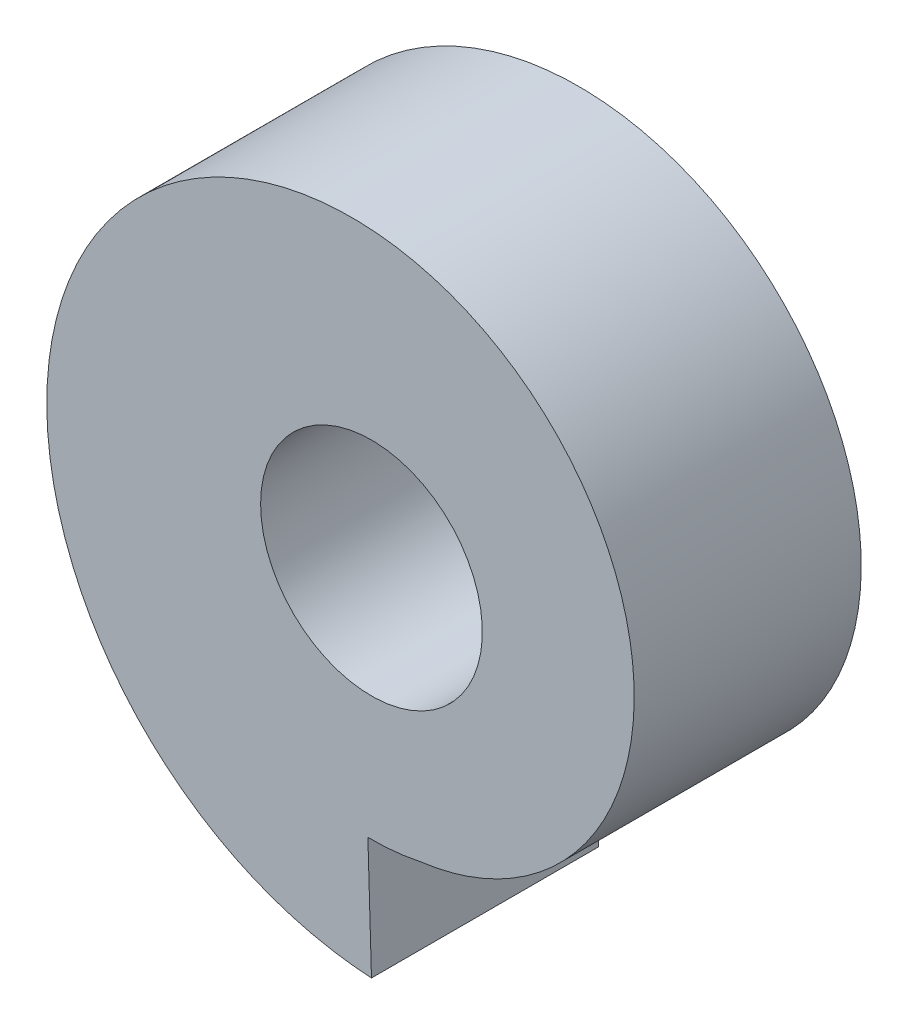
ISO-10303-21;
HEADER;
FILE_DESCRIPTION(('STEP AP214'),'2;1');
FILE_NAME('part.step','',(''),(''),'','','');
FILE_SCHEMA(('AUTOMOTIVE_DESIGN { 1 0 10303 214 1 1 1 1 }'));
ENDSEC;
DATA;
#1=APPLICATION_CONTEXT('core data for automotive mechanical design processes');
#2=APPLICATION_PROTOCOL_DEFINITION('international standard','automotive_design',2000,#1);
#3=PRODUCT_CONTEXT('',#1,'mechanical');
#4=PRODUCT('Part','Part','',(#3));
#5=PRODUCT_RELATED_PRODUCT_CATEGORY('part','',(#4));
#6=PRODUCT_DEFINITION_FORMATION('','',#4);
#7=PRODUCT_DEFINITION_CONTEXT('part definition',#1,'design');
#8=PRODUCT_DEFINITION('design','',#6,#7);
#9=PRODUCT_DEFINITION_SHAPE('','',#8);
#10=(LENGTH_UNIT() NAMED_UNIT(*) SI_UNIT(.MILLI.,.METRE.));
#11=(NAMED_UNIT(*) PLANE_ANGLE_UNIT() SI_UNIT($,.RADIAN.));
#12=(NAMED_UNIT(*) SI_UNIT($,.STERADIAN.) SOLID_ANGLE_UNIT());
#13=UNCERTAINTY_MEASURE_WITH_UNIT(LENGTH_MEASURE(1.E-05),#10,'distance_accuracy_value','');
#14=(GEOMETRIC_REPRESENTATION_CONTEXT(3) GLOBAL_UNCERTAINTY_ASSIGNED_CONTEXT((#13)) GLOBAL_UNIT_ASSIGNED_CONTEXT((#10,
#11,#12)) REPRESENTATION_CONTEXT('',''));
#15=CARTESIAN_POINT('',(0.,0.,0.));
#16=DIRECTION('',(0.,0.,1.));
#17=DIRECTION('',(1.,0.,0.));
#18=AXIS2_PLACEMENT_3D('',#15,#16,#17);
#19=CARTESIAN_POINT('',(-0.158316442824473,-26.1424127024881,0.));
#20=DIRECTION('',(-0.999556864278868,-0.0297670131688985,0.));
#21=DIRECTION('',(0.0297670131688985,-0.999556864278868,0.));
#22=AXIS2_PLACEMENT_3D('',#19,#20,#21);
#23=PLANE('',#22);
#24=DIRECTION('',(-0.0297670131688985,0.999556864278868,0.));
#25=VECTOR('',#24,1.);
#26=CARTESIAN_POINT('',(-0.158316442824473,-26.1424127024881,0.));
#27=LINE('',#26,#25);
#28=CARTESIAN_POINT('',(0.,-31.4585754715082,0.));
#29=VERTEX_POINT('',#28);
#30=CARTESIAN_POINT('',(-0.31663288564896,-20.826249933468,0.));
#31=VERTEX_POINT('',#30);
#32=EDGE_CURVE('E50',#29,#31,#27,.T.);
#33=ORIENTED_EDGE('',*,*,#32,.T.);
#34=DIRECTION('',(0.,0.,1.));
#35=VECTOR('',#34,1.);
#36=CARTESIAN_POINT('',(-0.31663288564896,-20.826249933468,10.0559952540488));
#37=LINE('',#36,#35);
#38=CARTESIAN_POINT('',(-0.31663288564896,-20.826249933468,20.1119905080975));
#39=VERTEX_POINT('',#38);
#40=EDGE_CURVE('E75',#31,#39,#37,.T.);
#41=ORIENTED_EDGE('',*,*,#40,.T.);
#42=DIRECTION('',(0.0297670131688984,-0.999556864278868,0.));
#43=VECTOR('',#42,1.);
#44=CARTESIAN_POINT('',(-0.158316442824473,-26.1424127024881,20.1119905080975));
#45=LINE('',#44,#43);
#46=CARTESIAN_POINT('',(0.,-31.4585754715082,20.1119905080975));
#47=VERTEX_POINT('',#46);
#48=EDGE_CURVE('E81',#39,#47,#45,.T.);
#49=ORIENTED_EDGE('',*,*,#48,.T.);
#50=DIRECTION('',(0.,0.,-1.));
#51=VECTOR('',#50,1.);
#52=CARTESIAN_POINT('',(0.,-31.4585754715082,10.0559952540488));
#53=LINE('',#52,#51);
#54=EDGE_CURVE('E92',#47,#29,#53,.T.);
#55=ORIENTED_EDGE('',*,*,#54,.T.);
#56=EDGE_LOOP('',(#33,#41,#49,#55));
#57=FACE_BOUND('',#56,.T.);
#58=ADVANCED_FACE('F42',(#57),#23,.F.);
#59=CARTESIAN_POINT('',(0.,-20.4585754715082,0.));
#60=DIRECTION('',(0.,0.,-1.));
#61=DIRECTION('',(0.,1.,0.));
#62=AXIS2_PLACEMENT_3D('',#59,#60,#61);
#63=PLANE('',#62);
#64=CARTESIAN_POINT('',(0.,0.,0.));
#65=DIRECTION('',(0.,0.,-1.));
#66=DIRECTION('',(-1.,0.,0.));
#67=AXIS2_PLACEMENT_3D('',#64,#65,#66);
#68=CIRCLE('',#67,9.82153628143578);
#69=CARTESIAN_POINT('',(-9.82153628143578,0.,0.));
#70=VERTEX_POINT('',#69);
#71=EDGE_CURVE('E78',#70,#70,#68,.T.);
#72=ORIENTED_EDGE('',*,*,#71,.F.);
#73=EDGE_LOOP('',(#72));
#74=FACE_BOUND('',#73,.T.);
#75=CARTESIAN_POINT('',(0.,-20.4585754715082,0.));
#76=CARTESIAN_POINT('',(1.3390106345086,-20.5731588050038,0.));
#77=CARTESIAN_POINT('',(2.70063028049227,-20.5558502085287,0.));
#78=CARTESIAN_POINT('',(5.41603446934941,-20.2493790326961,0.));
#79=CARTESIAN_POINT('',(6.76974749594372,-19.9602018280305,0.));
#80=CARTESIAN_POINT('',(9.41475798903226,-19.1126508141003,0.));
#81=CARTESIAN_POINT('',(10.7059814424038,-18.5542770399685,0.));
#82=CARTESIAN_POINT('',(13.172233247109,-17.18199666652,0.));
#83=CARTESIAN_POINT('',(14.3471880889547,-16.368105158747,0.));
#84=CARTESIAN_POINT('',(16.5301504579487,-14.5092333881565,0.));
#85=CARTESIAN_POINT('',(17.5380880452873,-13.464283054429,0.));
#86=CARTESIAN_POINT('',(19.3414563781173,-11.1778407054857,0.));
#87=CARTESIAN_POINT('',(20.1368237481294,-9.93639261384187,0.));
#88=CARTESIAN_POINT('',(21.4766976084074,-7.30049231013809,0.));
#89=CARTESIAN_POINT('',(22.0211500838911,-5.90609656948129,0.));
#90=CARTESIAN_POINT('',(22.8298184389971,-3.01531575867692,0.));
#91=CARTESIAN_POINT('',(23.0939921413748,-1.5189977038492,0.));
#92=CARTESIAN_POINT('',(23.3231588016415,1.5189977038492,0.));
#93=CARTESIAN_POINT('',(23.2881234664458,3.06059998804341,0.));
#94=CARTESIAN_POINT('',(22.9114248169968,6.12906153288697,0.));
#95=CARTESIAN_POINT('',(22.5697486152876,7.65584055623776,0.));
#96=CARTESIAN_POINT('',(21.5844414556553,10.6334238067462,0.));
#97=CARTESIAN_POINT('',(20.940813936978,12.0841457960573,0.));
#98=CARTESIAN_POINT('',(19.3685426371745,14.8497051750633,0.));
#99=CARTESIAN_POINT('',(18.4399188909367,16.1644616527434,0.));
#100=CARTESIAN_POINT('',(16.3265069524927,18.601964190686,0.));
#101=CARTESIAN_POINT('',(15.1417549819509,19.7246340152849,0.));
#102=CARTESIAN_POINT('',(12.5560050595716,21.7279932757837,0.));
#103=CARTESIAN_POINT('',(11.1550584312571,22.6086143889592,0.));
#104=CARTESIAN_POINT('',(8.18658537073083,24.0862443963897,0.));
#105=CARTESIAN_POINT('',(6.61912363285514,24.6831958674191,0.));
#106=CARTESIAN_POINT('',(3.37528546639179,25.5620916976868,0.));
#107=CARTESIAN_POINT('',(1.69898478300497,25.8439921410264,0.));
#108=CARTESIAN_POINT('',(-1.69898478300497,26.07315880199,0.));
#109=CARTESIAN_POINT('',(-3.42056969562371,26.0203967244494,0.));
#110=CARTESIAN_POINT('',(-6.84208859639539,25.573470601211,0.));
#111=CARTESIAN_POINT('',(-8.54193361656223,25.1792954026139,0.));
#112=CARTESIAN_POINT('',(-11.8520896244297,24.056232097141,0.));
#113=CARTESIAN_POINT('',(-13.4623101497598,23.327350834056,0.));
#114=CARTESIAN_POINT('',(-16.5271771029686,21.5550886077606,0.));
#115=CARTESIAN_POINT('',(-17.9817352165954,20.5117326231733,0.));
#116=CARTESIAN_POINT('',(-20.6737779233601,18.1437805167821,0.));
#117=CARTESIAN_POINT('',(-21.9111799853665,16.8192269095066,0.));
#118=CARTESIAN_POINT('',(-24.114530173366,13.9341694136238,0.));
#119=CARTESIAN_POINT('',(-25.080405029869,12.373724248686,0.));
#120=CARTESIAN_POINT('',(-26.6957911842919,9.07267843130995,0.));
#121=CARTESIAN_POINT('',(-27.3452416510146,7.33215069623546,0.));
#122=CARTESIAN_POINT('',(-28.2943649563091,3.73525517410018,0.));
#123=CARTESIAN_POINT('',(-28.5939921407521,1.87897186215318,0.));
#124=CARTESIAN_POINT('',(-28.8231588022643,-1.87897186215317,0.));
#125=CARTESIAN_POINT('',(-28.7526699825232,-3.78053940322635,0.));
#126=CARTESIAN_POINT('',(-28.2355163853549,-7.55511565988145,0.));
#127=CARTESIAN_POINT('',(-27.7888421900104,-9.42802667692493,0.));
#128=CARTESIAN_POINT('',(-26.5280227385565,-13.070755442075,0.));
#129=CARTESIAN_POINT('',(-25.7138877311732,-14.8404745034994,0.));
#130=CARTESIAN_POINT('',(-23.7416345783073,-18.2046490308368,0.));
#131=CARTESIAN_POINT('',(-22.5835463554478,-19.7990087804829,0.));
#132=CARTESIAN_POINT('',(-19.9610540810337,-22.7455916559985,0.));
#133=CARTESIAN_POINT('',(-18.4966988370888,-24.0977259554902,0.));
#134=CARTESIAN_POINT('',(-15.3123337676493,-26.5010670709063,0.));
#135=CARTESIAN_POINT('',(-13.5923900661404,-27.5521956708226,0.));
#136=CARTESIAN_POINT('',(-9.95877149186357,-29.3053379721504,0.));
#137=CARTESIAN_POINT('',(-8.04517775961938,-30.0072874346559,0.));
#138=CARTESIAN_POINT('',(-4.09522488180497,-31.0266382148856,0.));
#139=CARTESIAN_POINT('',(-2.05895895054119,-31.3439921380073,0.));
#140=CARTESIAN_POINT('',(0.,-31.4585754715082,0.));
#141=B_SPLINE_CURVE_WITH_KNOTS('',3,(#75,#76,#77,#78,#79,#80,#81,#82,#83,#84,#85,#86,#87,#88,
#89,#90,#91,#92,#93,#94,#95,#96,#97,#98,#99,#100,#101,#102,#103,#104,#105,#106,#107,#108,#109,
#110,#111,#112,#113,#114,#115,#116,#117,#118,#119,#120,#121,#122,#123,#124,#125,#126,#127,#128,
#129,#130,#131,#132,#133,#134,#135,#136,#137,#138,#139,#140),.UNSPECIFIED.,.F.,.F.,(4,2,2,2,2,2,
2,2,2,2,2,2,2,2,2,2,2,2,2,2,2,2,2,2,2,2,2,2,2,2,2,2,4),(0.,0.03125,0.0625,0.09375,0.125,0.15625,
0.1875,0.21875,0.25,0.28125,0.3125,0.34375,0.375,0.40625,0.4375,0.46875,0.5,0.53125,0.5625,
0.59375,0.625,0.65625,0.6875,0.71875,0.75,0.78125,0.8125,0.84375,0.875,0.90625,0.9375,0.96875,
1.),.UNSPECIFIED.);
#142=CARTESIAN_POINT('',(4.37032876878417,-20.3649986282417,0.));
#143=VERTEX_POINT('',#142);
#144=EDGE_CURVE('E94',#143,#29,#141,.T.);
#145=ORIENTED_EDGE('',*,*,#144,.F.);
#146=CARTESIAN_POINT('',(0.,0.,0.));
#147=DIRECTION('',(0.,0.,-1.));
#148=DIRECTION('',(-1.,0.,0.));
#149=AXIS2_PLACEMENT_3D('',#146,#147,#148);
#150=CIRCLE('',#149,20.8286567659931);
#151=EDGE_CURVE('E112',#143,#31,#150,.T.);
#152=ORIENTED_EDGE('',*,*,#151,.T.);
#153=ORIENTED_EDGE('',*,*,#32,.F.);
#154=EDGE_LOOP('',(#145,#152,#153));
#155=FACE_BOUND('',#154,.T.);
#156=ADVANCED_FACE('F111',(#74,#155),#63,.T.);
#157=CARTESIAN_POINT('',(0.,-9.82153628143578,20.1119905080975));
#158=DIRECTION('',(0.,0.,1.));
#159=DIRECTION('',(0.,-1.,0.));
#160=AXIS2_PLACEMENT_3D('',#157,#158,#159);
#161=PLANE('',#160);
#162=ORIENTED_EDGE('',*,*,#48,.F.);
#163=CARTESIAN_POINT('',(0.,0.,20.1119905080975));
#164=DIRECTION('',(0.,0.,1.));
#165=DIRECTION('',(1.,0.,0.));
#166=AXIS2_PLACEMENT_3D('',#163,#164,#165);
#167=CIRCLE('',#166,20.8286567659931);
#168=CARTESIAN_POINT('',(4.37032876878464,-20.3649986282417,20.1119905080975));
#169=VERTEX_POINT('',#168);
#170=EDGE_CURVE('E57',#169,#39,#167,.F.);
#171=ORIENTED_EDGE('',*,*,#170,.F.);
#172=CARTESIAN_POINT('',(0.,-20.4585754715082,20.1119905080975));
#173=CARTESIAN_POINT('',(1.3390106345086,-20.5731588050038,20.1119905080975));
#174=CARTESIAN_POINT('',(2.70063028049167,-20.5558502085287,20.1119905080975));
#175=CARTESIAN_POINT('',(5.41603446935,-20.2493790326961,20.1119905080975));
#176=CARTESIAN_POINT('',(6.76974749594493,-19.9602018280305,20.1119905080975));
#177=CARTESIAN_POINT('',(9.41475798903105,-19.1126508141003,20.1119905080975));
#178=CARTESIAN_POINT('',(10.7059814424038,-18.5542770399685,20.1119905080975));
#179=CARTESIAN_POINT('',(13.172233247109,-17.18199666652,20.1119905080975));
#180=CARTESIAN_POINT('',(14.3471880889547,-16.368105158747,20.1119905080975));
#181=CARTESIAN_POINT('',(16.5301504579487,-14.5092333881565,20.1119905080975));
#182=CARTESIAN_POINT('',(17.5380880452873,-13.464283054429,20.1119905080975));
#183=CARTESIAN_POINT('',(19.3414563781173,-11.1778407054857,20.1119905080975));
#184=CARTESIAN_POINT('',(20.1368237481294,-9.93639261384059,20.1119905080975));
#185=CARTESIAN_POINT('',(21.4766976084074,-7.30049231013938,20.1119905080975));
#186=CARTESIAN_POINT('',(22.0211500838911,-5.90609656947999,20.1119905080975));
#187=CARTESIAN_POINT('',(22.8298184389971,-3.01531575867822,20.1119905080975));
#188=CARTESIAN_POINT('',(23.0939921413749,-1.5189977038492,20.1119905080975));
#189=CARTESIAN_POINT('',(23.3231588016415,1.5189977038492,20.1119905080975));
#190=CARTESIAN_POINT('',(23.2881234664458,3.06059998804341,20.1119905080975));
#191=CARTESIAN_POINT('',(22.9114248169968,6.12906153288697,20.1119905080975));
#192=CARTESIAN_POINT('',(22.5697486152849,7.65584055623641,20.1119905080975));
#193=CARTESIAN_POINT('',(21.584441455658,10.6334238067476,20.1119905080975));
#194=CARTESIAN_POINT('',(20.940813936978,12.0841457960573,20.1119905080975));
#195=CARTESIAN_POINT('',(19.3685426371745,14.8497051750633,20.1119905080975));
#196=CARTESIAN_POINT('',(18.4399188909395,16.1644616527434,20.1119905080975));
#197=CARTESIAN_POINT('',(16.3265069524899,18.601964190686,20.1119905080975));
#198=CARTESIAN_POINT('',(15.1417549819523,19.7246340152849,20.1119905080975));
#199=CARTESIAN_POINT('',(12.5560050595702,21.7279932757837,20.1119905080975));
#200=CARTESIAN_POINT('',(11.1550584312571,22.6086143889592,20.1119905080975));
#201=CARTESIAN_POINT('',(8.18658537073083,24.0862443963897,20.1119905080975));
#202=CARTESIAN_POINT('',(6.61912363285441,24.6831958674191,20.1119905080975));
#203=CARTESIAN_POINT('',(3.37528546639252,25.5620916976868,20.1119905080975));
#204=CARTESIAN_POINT('',(1.69898478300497,25.8439921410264,20.1119905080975));
#205=CARTESIAN_POINT('',(-1.69898478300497,26.07315880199,20.1119905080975));
#206=CARTESIAN_POINT('',(-3.42056969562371,26.0203967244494,20.1119905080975));
#207=CARTESIAN_POINT('',(-6.84208859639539,25.573470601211,20.1119905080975));
#208=CARTESIAN_POINT('',(-8.54193361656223,25.1792954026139,20.1119905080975));
#209=CARTESIAN_POINT('',(-11.8520896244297,24.056232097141,20.1119905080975));
#210=CARTESIAN_POINT('',(-13.4623101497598,23.327350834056,20.1119905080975));
#211=CARTESIAN_POINT('',(-16.5271771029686,21.5550886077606,20.1119905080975));
#212=CARTESIAN_POINT('',(-17.9817352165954,20.5117326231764,20.1119905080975));
#213=CARTESIAN_POINT('',(-20.6737779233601,18.143780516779,20.1119905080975));
#214=CARTESIAN_POINT('',(-21.9111799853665,16.8192269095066,20.1119905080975));
#215=CARTESIAN_POINT('',(-24.114530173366,13.9341694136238,20.1119905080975));
#216=CARTESIAN_POINT('',(-25.080405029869,12.373724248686,20.1119905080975));
#217=CARTESIAN_POINT('',(-26.6957911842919,9.07267843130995,20.1119905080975));
#218=CARTESIAN_POINT('',(-27.3452416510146,7.33215069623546,20.1119905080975));
#219=CARTESIAN_POINT('',(-28.2943649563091,3.73525517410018,20.1119905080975));
#220=CARTESIAN_POINT('',(-28.5939921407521,1.87897186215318,20.1119905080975));
#221=CARTESIAN_POINT('',(-28.8231588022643,-1.87897186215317,20.1119905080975));
#222=CARTESIAN_POINT('',(-28.7526699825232,-3.78053940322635,20.1119905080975));
#223=CARTESIAN_POINT('',(-28.2355163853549,-7.55511565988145,20.1119905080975));
#224=CARTESIAN_POINT('',(-27.7888421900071,-9.42802667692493,20.1119905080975));
#225=CARTESIAN_POINT('',(-26.5280227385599,-13.070755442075,20.1119905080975));
#226=CARTESIAN_POINT('',(-25.7138877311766,-14.8404745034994,20.1119905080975));
#227=CARTESIAN_POINT('',(-23.7416345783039,-18.2046490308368,20.1119905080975));
#228=CARTESIAN_POINT('',(-22.5835463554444,-19.7990087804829,20.1119905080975));
#229=CARTESIAN_POINT('',(-19.9610540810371,-22.7455916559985,20.1119905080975));
#230=CARTESIAN_POINT('',(-18.4966988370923,-24.0977259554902,20.1119905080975));
#231=CARTESIAN_POINT('',(-15.3123337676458,-26.5010670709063,20.1119905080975));
#232=CARTESIAN_POINT('',(-13.5923900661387,-27.5521956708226,20.1119905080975));
#233=CARTESIAN_POINT('',(-9.95877149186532,-29.3053379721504,20.1119905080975));
#234=CARTESIAN_POINT('',(-8.04517775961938,-30.0072874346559,20.1119905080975));
#235=CARTESIAN_POINT('',(-4.09522488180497,-31.0266382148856,20.1119905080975));
#236=CARTESIAN_POINT('',(-2.05895895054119,-31.3439921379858,20.1119905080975));
#237=CARTESIAN_POINT('',(0.,-31.4585754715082,20.1119905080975));
#238=B_SPLINE_CURVE_WITH_KNOTS('',3,(#172,#173,#174,#175,#176,#177,#178,#179,#180,#181,#182,
#183,#184,#185,#186,#187,#188,#189,#190,#191,#192,#193,#194,#195,#196,#197,#198,#199,#200,#201,
#202,#203,#204,#205,#206,#207,#208,#209,#210,#211,#212,#213,#214,#215,#216,#217,#218,#219,#220,
#221,#222,#223,#224,#225,#226,#227,#228,#229,#230,#231,#232,#233,#234,#235,#236,#237),
.UNSPECIFIED.,.F.,.F.,(4,2,2,2,2,2,2,2,2,2,2,2,2,2,2,2,2,2,2,2,2,2,2,2,2,2,2,2,2,2,2,2,4),(0.,
0.03125,0.0625,0.09375,0.125,0.15625,0.1875,0.21875,0.25,0.28125,0.3125,0.34375,0.375,0.40625,
0.4375,0.46875,0.5,0.53125,0.5625,0.59375,0.625,0.65625,0.6875,0.71875,0.75,0.78125,0.8125,
0.84375,0.875,0.90625,0.9375,0.96875,1.),.UNSPECIFIED.);
#239=EDGE_CURVE('E60',#169,#47,#238,.T.);
#240=ORIENTED_EDGE('',*,*,#239,.T.);
#241=EDGE_LOOP('',(#162,#171,#240));
#242=FACE_BOUND('',#241,.T.);
#243=CARTESIAN_POINT('',(0.,0.,20.1119905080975));
#244=DIRECTION('',(0.,0.,1.));
#245=DIRECTION('',(1.,0.,0.));
#246=AXIS2_PLACEMENT_3D('',#243,#244,#245);
#247=CIRCLE('',#246,9.82153628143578);
#248=CARTESIAN_POINT('',(-9.82153628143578,0.,20.1119905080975));
#249=VERTEX_POINT('',#248);
#250=EDGE_CURVE('E95',#249,#249,#247,.F.);
#251=ORIENTED_EDGE('',*,*,#250,.T.);
#252=EDGE_LOOP('',(#251));
#253=FACE_BOUND('',#252,.T.);
#254=ADVANCED_FACE('F44',(#242,#253),#161,.T.);
#255=CARTESIAN_POINT('',(0.,-20.4585754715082,20.1119905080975));
#256=CARTESIAN_POINT('',(1.3390106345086,-20.5731588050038,20.1119905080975));
#257=CARTESIAN_POINT('',(2.70063028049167,-20.5558502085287,20.1119905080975));
#258=CARTESIAN_POINT('',(5.41603446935,-20.2493790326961,20.1119905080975));
#259=CARTESIAN_POINT('',(6.76974749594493,-19.9602018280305,20.1119905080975));
#260=CARTESIAN_POINT('',(9.41475798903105,-19.1126508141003,20.1119905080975));
#261=CARTESIAN_POINT('',(10.7059814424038,-18.5542770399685,20.1119905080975));
#262=CARTESIAN_POINT('',(13.172233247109,-17.18199666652,20.1119905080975));
#263=CARTESIAN_POINT('',(14.3471880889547,-16.368105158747,20.1119905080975));
#264=CARTESIAN_POINT('',(16.5301504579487,-14.5092333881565,20.1119905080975));
#265=CARTESIAN_POINT('',(17.5380880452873,-13.464283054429,20.1119905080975));
#266=CARTESIAN_POINT('',(19.3414563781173,-11.1778407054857,20.1119905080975));
#267=CARTESIAN_POINT('',(20.1368237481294,-9.93639261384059,20.1119905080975));
#268=CARTESIAN_POINT('',(21.4766976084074,-7.30049231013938,20.1119905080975));
#269=CARTESIAN_POINT('',(22.0211500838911,-5.90609656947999,20.1119905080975));
#270=CARTESIAN_POINT('',(22.8298184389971,-3.01531575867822,20.1119905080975));
#271=CARTESIAN_POINT('',(23.0939921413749,-1.5189977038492,20.1119905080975));
#272=CARTESIAN_POINT('',(23.3231588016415,1.5189977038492,20.1119905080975));
#273=CARTESIAN_POINT('',(23.2881234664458,3.06059998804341,20.1119905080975));
#274=CARTESIAN_POINT('',(22.9114248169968,6.12906153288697,20.1119905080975));
#275=CARTESIAN_POINT('',(22.5697486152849,7.65584055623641,20.1119905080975));
#276=CARTESIAN_POINT('',(21.584441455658,10.6334238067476,20.1119905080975));
#277=CARTESIAN_POINT('',(20.940813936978,12.0841457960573,20.1119905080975));
#278=CARTESIAN_POINT('',(19.3685426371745,14.8497051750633,20.1119905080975));
#279=CARTESIAN_POINT('',(18.4399188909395,16.1644616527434,20.1119905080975));
#280=CARTESIAN_POINT('',(16.3265069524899,18.601964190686,20.1119905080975));
#281=CARTESIAN_POINT('',(15.1417549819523,19.7246340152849,20.1119905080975));
#282=CARTESIAN_POINT('',(12.5560050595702,21.7279932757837,20.1119905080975));
#283=CARTESIAN_POINT('',(11.1550584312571,22.6086143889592,20.1119905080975));
#284=CARTESIAN_POINT('',(8.18658537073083,24.0862443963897,20.1119905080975));
#285=CARTESIAN_POINT('',(6.61912363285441,24.6831958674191,20.1119905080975));
#286=CARTESIAN_POINT('',(3.37528546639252,25.5620916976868,20.1119905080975));
#287=CARTESIAN_POINT('',(1.69898478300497,25.8439921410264,20.1119905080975));
#288=CARTESIAN_POINT('',(-1.69898478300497,26.07315880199,20.1119905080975));
#289=CARTESIAN_POINT('',(-3.42056969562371,26.0203967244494,20.1119905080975));
#290=CARTESIAN_POINT('',(-6.84208859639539,25.573470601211,20.1119905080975));
#291=CARTESIAN_POINT('',(-8.54193361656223,25.1792954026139,20.1119905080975));
#292=CARTESIAN_POINT('',(-11.8520896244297,24.056232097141,20.1119905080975));
#293=CARTESIAN_POINT('',(-13.4623101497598,23.327350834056,20.1119905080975));
#294=CARTESIAN_POINT('',(-16.5271771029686,21.5550886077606,20.1119905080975));
#295=CARTESIAN_POINT('',(-17.9817352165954,20.5117326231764,20.1119905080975));
#296=CARTESIAN_POINT('',(-20.6737779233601,18.143780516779,20.1119905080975));
#297=CARTESIAN_POINT('',(-21.9111799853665,16.8192269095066,20.1119905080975));
#298=CARTESIAN_POINT('',(-24.114530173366,13.9341694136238,20.1119905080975));
#299=CARTESIAN_POINT('',(-25.080405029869,12.373724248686,20.1119905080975));
#300=CARTESIAN_POINT('',(-26.6957911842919,9.07267843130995,20.1119905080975));
#301=CARTESIAN_POINT('',(-27.3452416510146,7.33215069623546,20.1119905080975));
#302=CARTESIAN_POINT('',(-28.2943649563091,3.73525517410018,20.1119905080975));
#303=CARTESIAN_POINT('',(-28.5939921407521,1.87897186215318,20.1119905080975));
#304=CARTESIAN_POINT('',(-28.8231588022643,-1.87897186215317,20.1119905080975));
#305=CARTESIAN_POINT('',(-28.7526699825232,-3.78053940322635,20.1119905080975));
#306=CARTESIAN_POINT('',(-28.2355163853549,-7.55511565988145,20.1119905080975));
#307=CARTESIAN_POINT('',(-27.7888421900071,-9.42802667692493,20.1119905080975));
#308=CARTESIAN_POINT('',(-26.5280227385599,-13.070755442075,20.1119905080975));
#309=CARTESIAN_POINT('',(-25.7138877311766,-14.8404745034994,20.1119905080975));
#310=CARTESIAN_POINT('',(-23.7416345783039,-18.2046490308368,20.1119905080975));
#311=CARTESIAN_POINT('',(-22.5835463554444,-19.7990087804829,20.1119905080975));
#312=CARTESIAN_POINT('',(-19.9610540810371,-22.7455916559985,20.1119905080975));
#313=CARTESIAN_POINT('',(-18.4966988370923,-24.0977259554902,20.1119905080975));
#314=CARTESIAN_POINT('',(-15.3123337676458,-26.5010670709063,20.1119905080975));
#315=CARTESIAN_POINT('',(-13.5923900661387,-27.5521956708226,20.1119905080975));
#316=CARTESIAN_POINT('',(-9.95877149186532,-29.3053379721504,20.1119905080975));
#317=CARTESIAN_POINT('',(-8.04517775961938,-30.0072874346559,20.1119905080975));
#318=CARTESIAN_POINT('',(-4.09522488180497,-31.0266382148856,20.1119905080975));
#319=CARTESIAN_POINT('',(-2.05895895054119,-31.3439921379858,20.1119905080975));
#320=CARTESIAN_POINT('',(0.,-31.4585754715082,20.1119905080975));
#321=CARTESIAN_POINT('',(0.,-20.4585754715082,0.));
#322=CARTESIAN_POINT('',(1.3390106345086,-20.5731588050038,0.));
#323=CARTESIAN_POINT('',(2.70063028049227,-20.5558502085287,0.));
#324=CARTESIAN_POINT('',(5.41603446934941,-20.2493790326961,0.));
#325=CARTESIAN_POINT('',(6.76974749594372,-19.9602018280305,0.));
#326=CARTESIAN_POINT('',(9.41475798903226,-19.1126508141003,0.));
#327=CARTESIAN_POINT('',(10.7059814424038,-18.5542770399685,0.));
#328=CARTESIAN_POINT('',(13.172233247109,-17.18199666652,0.));
#329=CARTESIAN_POINT('',(14.3471880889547,-16.368105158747,0.));
#330=CARTESIAN_POINT('',(16.5301504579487,-14.5092333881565,0.));
#331=CARTESIAN_POINT('',(17.5380880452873,-13.464283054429,0.));
#332=CARTESIAN_POINT('',(19.3414563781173,-11.1778407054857,0.));
#333=CARTESIAN_POINT('',(20.1368237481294,-9.93639261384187,0.));
#334=CARTESIAN_POINT('',(21.4766976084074,-7.30049231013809,0.));
#335=CARTESIAN_POINT('',(22.0211500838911,-5.90609656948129,0.));
#336=CARTESIAN_POINT('',(22.8298184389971,-3.01531575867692,0.));
#337=CARTESIAN_POINT('',(23.0939921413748,-1.5189977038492,0.));
#338=CARTESIAN_POINT('',(23.3231588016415,1.5189977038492,0.));
#339=CARTESIAN_POINT('',(23.2881234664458,3.06059998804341,0.));
#340=CARTESIAN_POINT('',(22.9114248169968,6.12906153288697,0.));
#341=CARTESIAN_POINT('',(22.5697486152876,7.65584055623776,0.));
#342=CARTESIAN_POINT('',(21.5844414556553,10.6334238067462,0.));
#343=CARTESIAN_POINT('',(20.940813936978,12.0841457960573,0.));
#344=CARTESIAN_POINT('',(19.3685426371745,14.8497051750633,0.));
#345=CARTESIAN_POINT('',(18.4399188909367,16.1644616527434,0.));
#346=CARTESIAN_POINT('',(16.3265069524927,18.601964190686,0.));
#347=CARTESIAN_POINT('',(15.1417549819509,19.7246340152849,0.));
#348=CARTESIAN_POINT('',(12.5560050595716,21.7279932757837,0.));
#349=CARTESIAN_POINT('',(11.1550584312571,22.6086143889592,0.));
#350=CARTESIAN_POINT('',(8.18658537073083,24.0862443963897,0.));
#351=CARTESIAN_POINT('',(6.61912363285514,24.6831958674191,0.));
#352=CARTESIAN_POINT('',(3.37528546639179,25.5620916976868,0.));
#353=CARTESIAN_POINT('',(1.69898478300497,25.8439921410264,0.));
#354=CARTESIAN_POINT('',(-1.69898478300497,26.07315880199,0.));
#355=CARTESIAN_POINT('',(-3.42056969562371,26.0203967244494,0.));
#356=CARTESIAN_POINT('',(-6.84208859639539,25.573470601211,0.));
#357=CARTESIAN_POINT('',(-8.54193361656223,25.1792954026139,0.));
#358=CARTESIAN_POINT('',(-11.8520896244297,24.056232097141,0.));
#359=CARTESIAN_POINT('',(-13.4623101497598,23.327350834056,0.));
#360=CARTESIAN_POINT('',(-16.5271771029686,21.5550886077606,0.));
#361=CARTESIAN_POINT('',(-17.9817352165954,20.5117326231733,0.));
#362=CARTESIAN_POINT('',(-20.6737779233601,18.1437805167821,0.));
#363=CARTESIAN_POINT('',(-21.9111799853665,16.8192269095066,0.));
#364=CARTESIAN_POINT('',(-24.114530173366,13.9341694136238,0.));
#365=CARTESIAN_POINT('',(-25.080405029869,12.373724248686,0.));
#366=CARTESIAN_POINT('',(-26.6957911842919,9.07267843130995,0.));
#367=CARTESIAN_POINT('',(-27.3452416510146,7.33215069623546,0.));
#368=CARTESIAN_POINT('',(-28.2943649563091,3.73525517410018,0.));
#369=CARTESIAN_POINT('',(-28.5939921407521,1.87897186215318,0.));
#370=CARTESIAN_POINT('',(-28.8231588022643,-1.87897186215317,0.));
#371=CARTESIAN_POINT('',(-28.7526699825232,-3.78053940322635,0.));
#372=CARTESIAN_POINT('',(-28.2355163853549,-7.55511565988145,0.));
#373=CARTESIAN_POINT('',(-27.7888421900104,-9.42802667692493,0.));
#374=CARTESIAN_POINT('',(-26.5280227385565,-13.070755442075,0.));
#375=CARTESIAN_POINT('',(-25.7138877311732,-14.8404745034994,0.));
#376=CARTESIAN_POINT('',(-23.7416345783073,-18.2046490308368,0.));
#377=CARTESIAN_POINT('',(-22.5835463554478,-19.7990087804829,0.));
#378=CARTESIAN_POINT('',(-19.9610540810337,-22.7455916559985,0.));
#379=CARTESIAN_POINT('',(-18.4966988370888,-24.0977259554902,0.));
#380=CARTESIAN_POINT('',(-15.3123337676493,-26.5010670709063,0.));
#381=CARTESIAN_POINT('',(-13.5923900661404,-27.5521956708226,0.));
#382=CARTESIAN_POINT('',(-9.95877149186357,-29.3053379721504,0.));
#383=CARTESIAN_POINT('',(-8.04517775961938,-30.0072874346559,0.));
#384=CARTESIAN_POINT('',(-4.09522488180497,-31.0266382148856,0.));
#385=CARTESIAN_POINT('',(-2.05895895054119,-31.3439921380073,0.));
#386=CARTESIAN_POINT('',(0.,-31.4585754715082,0.));
#387=B_SPLINE_SURFACE_WITH_KNOTS('',1,3,((#255,#256,#257,#258,#259,#260,#261,#262,#263,#264,
#265,#266,#267,#268,#269,#270,#271,#272,#273,#274,#275,#276,#277,#278,#279,#280,#281,#282,#283,
#284,#285,#286,#287,#288,#289,#290,#291,#292,#293,#294,#295,#296,#297,#298,#299,#300,#301,#302,
#303,#304,#305,#306,#307,#308,#309,#310,#311,#312,#313,#314,#315,#316,#317,#318,#319,#320),
(#321,#322,#323,#324,#325,#326,#327,#328,#329,#330,#331,#332,#333,#334,#335,#336,#337,#338,#339,
#340,#341,#342,#343,#344,#345,#346,#347,#348,#349,#350,#351,#352,#353,#354,#355,#356,#357,#358,
#359,#360,#361,#362,#363,#364,#365,#366,#367,#368,#369,#370,#371,#372,#373,#374,#375,#376,#377,
#378,#379,#380,#381,#382,#383,#384,#385,#386)),.UNSPECIFIED.,.F.,.F.,.F.,(2,2),(4,2,2,2,2,2,2,2,
2,2,2,2,2,2,2,2,2,2,2,2,2,2,2,2,2,2,2,2,2,2,2,2,4),(0.672965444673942,1.),(0.,0.03125,0.0625,
0.09375,0.125,0.15625,0.1875,0.21875,0.25,0.28125,0.3125,0.34375,0.375,0.40625,0.4375,0.46875,
0.5,0.53125,0.5625,0.59375,0.625,0.65625,0.6875,0.71875,0.75,0.78125,0.8125,0.84375,0.875,
0.90625,0.9375,0.96875,1.),.UNSPECIFIED.);
#388=DIRECTION('',(0.,0.,-1.));
#389=VECTOR('',#388,1.);
#390=CARTESIAN_POINT('',(4.37032876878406,-20.3649986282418,10.0559952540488));
#391=LINE('',#390,#389);
#392=EDGE_CURVE('E13',#143,#169,#391,.F.);
#393=ORIENTED_EDGE('',*,*,#392,.F.);
#394=ORIENTED_EDGE('',*,*,#144,.T.);
#395=ORIENTED_EDGE('',*,*,#54,.F.);
#396=ORIENTED_EDGE('',*,*,#239,.F.);
#397=EDGE_LOOP('',(#393,#394,#395,#396));
#398=FACE_BOUND('',#397,.T.);
#399=ADVANCED_FACE('F109',(#398),#387,.T.);
#400=CARTESIAN_POINT('',(0.,0.,79.0243282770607));
#401=DIRECTION('',(0.,0.,-1.));
#402=DIRECTION('',(-1.,0.,0.));
#403=AXIS2_PLACEMENT_3D('',#400,#401,#402);
#404=CYLINDRICAL_SURFACE('',#403,20.8286567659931);
#405=ORIENTED_EDGE('',*,*,#170,.T.);
#406=ORIENTED_EDGE('',*,*,#40,.F.);
#407=ORIENTED_EDGE('',*,*,#151,.F.);
#408=ORIENTED_EDGE('',*,*,#392,.T.);
#409=EDGE_LOOP('',(#405,#406,#407,#408));
#410=FACE_BOUND('',#409,.T.);
#411=ADVANCED_FACE('F73',(#410),#404,.T.);
#412=CARTESIAN_POINT('',(0.,0.,79.0243282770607));
#413=DIRECTION('',(0.,0.,-1.));
#414=DIRECTION('',(-1.,0.,0.));
#415=AXIS2_PLACEMENT_3D('',#412,#413,#414);
#416=CYLINDRICAL_SURFACE('',#415,9.82153628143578);
#417=CARTESIAN_POINT('',(-9.82153628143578,0.,0.));
#418=CARTESIAN_POINT('',(-9.82153628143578,0.,0.209499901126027));
#419=CARTESIAN_POINT('',(-9.82153628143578,0.,0.418999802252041));
#420=CARTESIAN_POINT('',(-9.82153628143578,0.,0.837999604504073));
#421=CARTESIAN_POINT('',(-9.82153628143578,0.,1.04749950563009));
#422=CARTESIAN_POINT('',(-9.82153628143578,0.,1.46649930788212));
#423=CARTESIAN_POINT('',(-9.82153628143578,0.,1.67599920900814));
#424=CARTESIAN_POINT('',(-9.82153628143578,0.,2.09499901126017));
#425=CARTESIAN_POINT('',(-9.82153628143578,0.,2.30449891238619));
#426=CARTESIAN_POINT('',(-9.82153628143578,0.,2.72349871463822));
#427=CARTESIAN_POINT('',(-9.82153628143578,0.,2.93299861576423));
#428=CARTESIAN_POINT('',(-9.82153628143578,0.,3.35199841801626));
#429=CARTESIAN_POINT('',(-9.82153628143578,0.,3.56149831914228));
#430=CARTESIAN_POINT('',(-9.82153628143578,0.,3.98049812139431));
#431=CARTESIAN_POINT('',(-9.82153628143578,0.,4.18999802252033));
#432=CARTESIAN_POINT('',(-9.82153628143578,0.,4.60899782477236));
#433=CARTESIAN_POINT('',(-9.82153628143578,0.,4.81849772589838));
#434=CARTESIAN_POINT('',(-9.82153628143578,0.,5.23749752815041));
#435=CARTESIAN_POINT('',(-9.82153628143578,0.,5.44699742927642));
#436=CARTESIAN_POINT('',(-9.82153628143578,0.,5.86599723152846));
#437=CARTESIAN_POINT('',(-9.82153628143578,0.,6.07549713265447));
#438=CARTESIAN_POINT('',(-9.82153628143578,0.,6.49449693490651));
#439=CARTESIAN_POINT('',(-9.82153628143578,0.,6.70399683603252));
#440=CARTESIAN_POINT('',(-9.82153628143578,0.,7.12299663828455));
#441=CARTESIAN_POINT('',(-9.82153628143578,0.,7.33249653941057));
#442=CARTESIAN_POINT('',(-9.82153628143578,0.,7.7514963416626));
#443=CARTESIAN_POINT('',(-9.82153628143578,0.,7.96099624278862));
#444=CARTESIAN_POINT('',(-9.82153628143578,0.,8.37999604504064));
#445=CARTESIAN_POINT('',(-9.82153628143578,0.,8.58949594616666));
#446=CARTESIAN_POINT('',(-9.82153628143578,0.,9.00849574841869));
#447=CARTESIAN_POINT('',(-9.82153628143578,0.,9.21799564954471));
#448=CARTESIAN_POINT('',(-9.82153628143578,0.,9.63699545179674));
#449=CARTESIAN_POINT('',(-9.82153628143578,0.,9.84649535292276));
#450=CARTESIAN_POINT('',(-9.82153628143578,0.,10.2654951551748));
#451=CARTESIAN_POINT('',(-9.82153628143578,0.,10.4749950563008));
#452=CARTESIAN_POINT('',(-9.82153628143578,0.,10.8939948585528));
#453=CARTESIAN_POINT('',(-9.82153628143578,0.,11.1034947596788));
#454=CARTESIAN_POINT('',(-9.82153628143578,0.,11.5224945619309));
#455=CARTESIAN_POINT('',(-9.82153628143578,0.,11.7319944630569));
#456=CARTESIAN_POINT('',(-9.82153628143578,0.,12.1509942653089));
#457=CARTESIAN_POINT('',(-9.82153628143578,0.,12.3604941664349));
#458=CARTESIAN_POINT('',(-9.82153628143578,0.,12.779493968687));
#459=CARTESIAN_POINT('',(-9.82153628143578,0.,12.988993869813));
#460=CARTESIAN_POINT('',(-9.82153628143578,0.,13.407993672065));
#461=CARTESIAN_POINT('',(-9.82153628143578,0.,13.617493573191));
#462=CARTESIAN_POINT('',(-9.82153628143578,0.,14.0364933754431));
#463=CARTESIAN_POINT('',(-9.82153628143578,0.,14.2459932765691));
#464=CARTESIAN_POINT('',(-9.82153628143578,0.,14.6649930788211));
#465=CARTESIAN_POINT('',(-9.82153628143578,0.,14.8744929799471));
#466=CARTESIAN_POINT('',(-9.82153628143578,0.,15.2934927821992));
#467=CARTESIAN_POINT('',(-9.82153628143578,0.,15.5029926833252));
#468=CARTESIAN_POINT('',(-9.82153628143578,0.,15.9219924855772));
#469=CARTESIAN_POINT('',(-9.82153628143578,0.,16.1314923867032));
#470=CARTESIAN_POINT('',(-9.82153628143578,0.,16.5504921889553));
#471=CARTESIAN_POINT('',(-9.82153628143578,0.,16.7599920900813));
#472=CARTESIAN_POINT('',(-9.82153628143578,0.,17.1789918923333));
#473=CARTESIAN_POINT('',(-9.82153628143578,0.,17.3884917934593));
#474=CARTESIAN_POINT('',(-9.82153628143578,0.,17.8074915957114));
#475=CARTESIAN_POINT('',(-9.82153628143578,0.,18.0169914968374));
#476=CARTESIAN_POINT('',(-9.82153628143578,0.,18.4359912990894));
#477=CARTESIAN_POINT('',(-9.82153628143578,0.,18.6454912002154));
#478=CARTESIAN_POINT('',(-9.82153628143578,0.,19.0644910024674));
#479=CARTESIAN_POINT('',(-9.82153628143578,0.,19.2739909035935));
#480=CARTESIAN_POINT('',(-9.82153628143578,0.,19.6929907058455));
#481=CARTESIAN_POINT('',(-9.82153628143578,0.,19.9024906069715));
#482=CARTESIAN_POINT('',(-9.82153628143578,0.,20.1119905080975));
#483=B_SPLINE_CURVE_WITH_KNOTS('',3,(#417,#418,#419,#420,#421,#422,#423,#424,#425,#426,#427,
#428,#429,#430,#431,#432,#433,#434,#435,#436,#437,#438,#439,#440,#441,#442,#443,#444,#445,#446,
#447,#448,#449,#450,#451,#452,#453,#454,#455,#456,#457,#458,#459,#460,#461,#462,#463,#464,#465,
#466,#467,#468,#469,#470,#471,#472,#473,#474,#475,#476,#477,#478,#479,#480,#481,#482),
.UNSPECIFIED.,.F.,.F.,(4,2,2,2,2,2,2,2,2,2,2,2,2,2,2,2,2,2,2,2,2,2,2,2,2,2,2,2,2,2,2,2,4),(0.,
0.628499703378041,1.2569994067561,1.88549911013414,2.51399881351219,3.14249851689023,
3.77099822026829,4.39949792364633,5.02799762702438,5.65649733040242,6.28499703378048,
6.91349673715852,7.54199644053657,8.17049614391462,8.79899584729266,9.42749555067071,
10.0559952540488,10.6844949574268,11.3129946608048,11.9414943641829,12.5699940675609,
13.198493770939,13.826993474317,14.4554931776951,15.0839928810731,15.7124925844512,
16.3409922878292,16.9694919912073,17.5979916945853,18.2264913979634,18.8549911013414,
19.4834908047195,20.1119905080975),.UNSPECIFIED.);
#484=EDGE_CURVE('BSEAM119',#70,#249,#483,.T.);
#485=ORIENTED_EDGE('',*,*,#71,.T.);
#486=ORIENTED_EDGE('',*,*,#250,.F.);
#487=ORIENTED_EDGE('',*,*,#484,.T.);
#488=ORIENTED_EDGE('',*,*,#484,.F.);
#489=EDGE_LOOP('',(#485,#487,#486,#488));
#490=FACE_BOUND('',#489,.T.);
#491=ADVANCED_FACE('F119',(#490),#416,.F.);
#492=CLOSED_SHELL('',(#58,#156,#254,#399,#411,#491));
#493=MANIFOLD_SOLID_BREP('B2',#492);
#494=ADVANCED_BREP_SHAPE_REPRESENTATION('',(#18,#493),#14);
#495=SHAPE_DEFINITION_REPRESENTATION(#9,#494);
ENDSEC;
END-ISO-10303-21;
